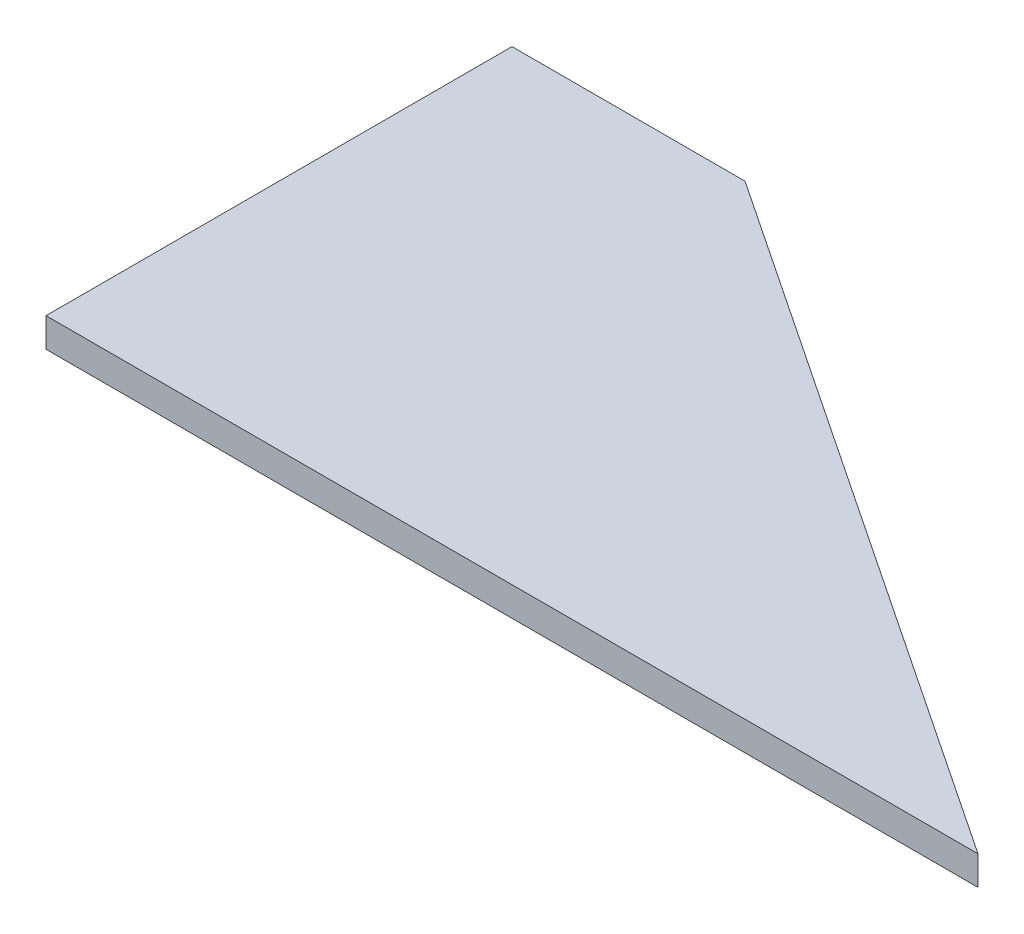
from build123d import *

# Parameters (mm, degrees)
BOSS_EXTRUDE1_DEPTH = 9.525


with BuildPart() as part:
    # Sketch1 → Boss-Extrude1 (new body)
    with BuildSketch(Plane(origin=(0, 0, 0), x_dir=(1, 0, 0), z_dir=(0, 1, 0))):
        Polygon((0, 0), (0, 152.4), (76.2, 152.4), (304.8, 0), align=None)
    extrude(amount=BOSS_EXTRUDE1_DEPTH)


solid = part.part
